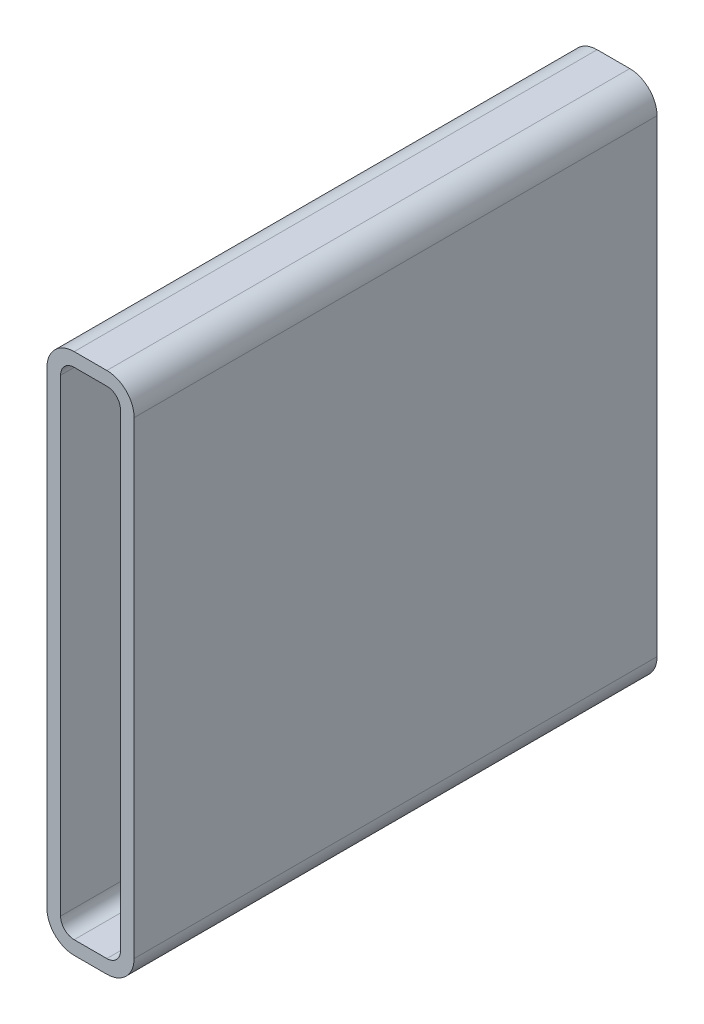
ISO-10303-21;
HEADER;
FILE_DESCRIPTION(('STEP AP214'),'2;1');
FILE_NAME('part.step','',(''),(''),'','','');
FILE_SCHEMA(('AUTOMOTIVE_DESIGN { 1 0 10303 214 1 1 1 1 }'));
ENDSEC;
DATA;
#1=APPLICATION_CONTEXT('core data for automotive mechanical design processes');
#2=APPLICATION_PROTOCOL_DEFINITION('international standard','automotive_design',2000,#1);
#3=PRODUCT_CONTEXT('',#1,'mechanical');
#4=PRODUCT('Part','Part','',(#3));
#5=PRODUCT_RELATED_PRODUCT_CATEGORY('part','',(#4));
#6=PRODUCT_DEFINITION_FORMATION('','',#4);
#7=PRODUCT_DEFINITION_CONTEXT('part definition',#1,'design');
#8=PRODUCT_DEFINITION('design','',#6,#7);
#9=PRODUCT_DEFINITION_SHAPE('','',#8);
#10=(LENGTH_UNIT() NAMED_UNIT(*) SI_UNIT(.MILLI.,.METRE.));
#11=(NAMED_UNIT(*) PLANE_ANGLE_UNIT() SI_UNIT($,.RADIAN.));
#12=(NAMED_UNIT(*) SI_UNIT($,.STERADIAN.) SOLID_ANGLE_UNIT());
#13=UNCERTAINTY_MEASURE_WITH_UNIT(LENGTH_MEASURE(1.E-05),#10,'distance_accuracy_value','');
#14=(GEOMETRIC_REPRESENTATION_CONTEXT(3) GLOBAL_UNCERTAINTY_ASSIGNED_CONTEXT((#13)) GLOBAL_UNIT_ASSIGNED_CONTEXT((#10,
#11,#12)) REPRESENTATION_CONTEXT('',''));
#15=CARTESIAN_POINT('',(0.,0.,0.));
#16=DIRECTION('',(0.,0.,1.));
#17=DIRECTION('',(1.,0.,0.));
#18=AXIS2_PLACEMENT_3D('',#15,#16,#17);
#19=CARTESIAN_POINT('',(15.875,288.925,304.8));
#20=DIRECTION('',(0.,0.,1.));
#21=DIRECTION('',(1.,0.,0.));
#22=AXIS2_PLACEMENT_3D('',#19,#20,#21);
#23=PLANE('',#22);
#24=CARTESIAN_POINT('',(15.875,288.925,304.8));
#25=DIRECTION('',(0.,0.,1.));
#26=DIRECTION('',(1.,0.,0.));
#27=AXIS2_PLACEMENT_3D('',#24,#25,#26);
#28=CIRCLE('',#27,15.875);
#29=CARTESIAN_POINT('',(15.875,304.8,304.8));
#30=VERTEX_POINT('',#29);
#31=CARTESIAN_POINT('',(0.,288.925,304.8));
#32=VERTEX_POINT('',#31);
#33=EDGE_CURVE('E211',#30,#32,#28,.T.);
#34=ORIENTED_EDGE('',*,*,#33,.T.);
#35=DIRECTION('',(0.,-1.,0.));
#36=VECTOR('',#35,1.);
#37=CARTESIAN_POINT('',(0.,15.875,304.8));
#38=LINE('',#37,#36);
#39=CARTESIAN_POINT('',(0.,15.875,304.8));
#40=VERTEX_POINT('',#39);
#41=EDGE_CURVE('E214',#32,#40,#38,.T.);
#42=ORIENTED_EDGE('',*,*,#41,.T.);
#43=CARTESIAN_POINT('',(15.875,15.875,304.8));
#44=DIRECTION('',(0.,0.,1.));
#45=DIRECTION('',(1.,0.,0.));
#46=AXIS2_PLACEMENT_3D('',#43,#44,#45);
#47=CIRCLE('',#46,15.875);
#48=CARTESIAN_POINT('',(15.875,0.,304.8));
#49=VERTEX_POINT('',#48);
#50=EDGE_CURVE('E217',#40,#49,#47,.T.);
#51=ORIENTED_EDGE('',*,*,#50,.T.);
#52=DIRECTION('',(1.,0.,0.));
#53=VECTOR('',#52,1.);
#54=CARTESIAN_POINT('',(34.925,0.,304.8));
#55=LINE('',#54,#53);
#56=CARTESIAN_POINT('',(34.925,0.,304.8));
#57=VERTEX_POINT('',#56);
#58=EDGE_CURVE('E219',#49,#57,#55,.T.);
#59=ORIENTED_EDGE('',*,*,#58,.T.);
#60=CARTESIAN_POINT('',(34.925,15.875,304.8));
#61=DIRECTION('',(0.,0.,1.));
#62=DIRECTION('',(1.,0.,0.));
#63=AXIS2_PLACEMENT_3D('',#60,#61,#62);
#64=CIRCLE('',#63,15.875);
#65=CARTESIAN_POINT('',(50.8,15.875,304.8));
#66=VERTEX_POINT('',#65);
#67=EDGE_CURVE('E221',#57,#66,#64,.T.);
#68=ORIENTED_EDGE('',*,*,#67,.T.);
#69=DIRECTION('',(0.,1.,0.));
#70=VECTOR('',#69,1.);
#71=CARTESIAN_POINT('',(50.8,288.925,304.8));
#72=LINE('',#71,#70);
#73=CARTESIAN_POINT('',(50.8,288.925,304.8));
#74=VERTEX_POINT('',#73);
#75=EDGE_CURVE('E223',#66,#74,#72,.T.);
#76=ORIENTED_EDGE('',*,*,#75,.T.);
#77=CARTESIAN_POINT('',(34.925,288.925,304.8));
#78=DIRECTION('',(0.,0.,1.));
#79=DIRECTION('',(1.,0.,0.));
#80=AXIS2_PLACEMENT_3D('',#77,#78,#79);
#81=CIRCLE('',#80,15.875);
#82=CARTESIAN_POINT('',(34.925,304.8,304.8));
#83=VERTEX_POINT('',#82);
#84=EDGE_CURVE('E225',#74,#83,#81,.T.);
#85=ORIENTED_EDGE('',*,*,#84,.T.);
#86=DIRECTION('',(-1.,0.,0.));
#87=VECTOR('',#86,1.);
#88=CARTESIAN_POINT('',(15.875,304.8,304.8));
#89=LINE('',#88,#87);
#90=EDGE_CURVE('E227',#83,#30,#89,.T.);
#91=ORIENTED_EDGE('',*,*,#90,.T.);
#92=EDGE_LOOP('',(#34,#42,#51,#59,#68,#76,#85,#91));
#93=FACE_BOUND('',#92,.T.);
#94=DIRECTION('',(0.,-1.,0.));
#95=VECTOR('',#94,1.);
#96=CARTESIAN_POINT('',(7.9375,15.875,304.8));
#97=LINE('',#96,#95);
#98=CARTESIAN_POINT('',(7.9375,288.925,304.8));
#99=VERTEX_POINT('',#98);
#100=CARTESIAN_POINT('',(7.9375,15.875,304.8));
#101=VERTEX_POINT('',#100);
#102=EDGE_CURVE('E154',#99,#101,#97,.T.);
#103=ORIENTED_EDGE('',*,*,#102,.F.);
#104=CARTESIAN_POINT('',(15.875,288.925,304.8));
#105=DIRECTION('',(0.,0.,1.));
#106=DIRECTION('',(1.,0.,0.));
#107=AXIS2_PLACEMENT_3D('',#104,#105,#106);
#108=CIRCLE('',#107,7.9375);
#109=CARTESIAN_POINT('',(15.875,296.8625,304.8));
#110=VERTEX_POINT('',#109);
#111=EDGE_CURVE('E146',#110,#99,#108,.T.);
#112=ORIENTED_EDGE('',*,*,#111,.F.);
#113=DIRECTION('',(-1.,0.,0.));
#114=VECTOR('',#113,1.);
#115=CARTESIAN_POINT('',(15.875,296.8625,304.8));
#116=LINE('',#115,#114);
#117=CARTESIAN_POINT('',(34.925,296.8625,304.8));
#118=VERTEX_POINT('',#117);
#119=EDGE_CURVE('E179',#118,#110,#116,.T.);
#120=ORIENTED_EDGE('',*,*,#119,.F.);
#121=CARTESIAN_POINT('',(34.925,288.925,304.8));
#122=DIRECTION('',(0.,0.,1.));
#123=DIRECTION('',(1.,0.,0.));
#124=AXIS2_PLACEMENT_3D('',#121,#122,#123);
#125=CIRCLE('',#124,7.9375);
#126=CARTESIAN_POINT('',(42.8625,288.925,304.8));
#127=VERTEX_POINT('',#126);
#128=EDGE_CURVE('E177',#127,#118,#125,.T.);
#129=ORIENTED_EDGE('',*,*,#128,.F.);
#130=DIRECTION('',(0.,1.,0.));
#131=VECTOR('',#130,1.);
#132=CARTESIAN_POINT('',(42.8625,288.925,304.8));
#133=LINE('',#132,#131);
#134=CARTESIAN_POINT('',(42.8625,15.875,304.8));
#135=VERTEX_POINT('',#134);
#136=EDGE_CURVE('E175',#135,#127,#133,.T.);
#137=ORIENTED_EDGE('',*,*,#136,.F.);
#138=CARTESIAN_POINT('',(34.925,15.875,304.8));
#139=DIRECTION('',(0.,0.,1.));
#140=DIRECTION('',(1.,0.,0.));
#141=AXIS2_PLACEMENT_3D('',#138,#139,#140);
#142=CIRCLE('',#141,7.9375);
#143=CARTESIAN_POINT('',(34.925,7.93750000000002,304.8));
#144=VERTEX_POINT('',#143);
#145=EDGE_CURVE('E173',#144,#135,#142,.T.);
#146=ORIENTED_EDGE('',*,*,#145,.F.);
#147=DIRECTION('',(1.,0.,0.));
#148=VECTOR('',#147,1.);
#149=CARTESIAN_POINT('',(34.925,7.93750000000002,304.8));
#150=LINE('',#149,#148);
#151=CARTESIAN_POINT('',(15.875,7.93750000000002,304.8));
#152=VERTEX_POINT('',#151);
#153=EDGE_CURVE('E169',#152,#144,#150,.T.);
#154=ORIENTED_EDGE('',*,*,#153,.F.);
#155=CARTESIAN_POINT('',(15.875,15.875,304.8));
#156=DIRECTION('',(0.,0.,1.));
#157=DIRECTION('',(1.,0.,0.));
#158=AXIS2_PLACEMENT_3D('',#155,#156,#157);
#159=CIRCLE('',#158,7.9375);
#160=EDGE_CURVE('E167',#101,#152,#159,.T.);
#161=ORIENTED_EDGE('',*,*,#160,.F.);
#162=EDGE_LOOP('',(#103,#112,#120,#129,#137,#146,#154,#161));
#163=FACE_BOUND('',#162,.T.);
#164=ADVANCED_FACE('F33',(#93,#163),#23,.T.);
#165=CARTESIAN_POINT('',(15.875,288.925,0.));
#166=DIRECTION('',(0.,0.,1.));
#167=DIRECTION('',(1.,0.,0.));
#168=AXIS2_PLACEMENT_3D('',#165,#166,#167);
#169=PLANE('',#168);
#170=CARTESIAN_POINT('',(15.875,288.925,0.));
#171=DIRECTION('',(0.,0.,1.));
#172=DIRECTION('',(1.,0.,0.));
#173=AXIS2_PLACEMENT_3D('',#170,#171,#172);
#174=CIRCLE('',#173,15.875);
#175=CARTESIAN_POINT('',(15.875,304.8,0.));
#176=VERTEX_POINT('',#175);
#177=CARTESIAN_POINT('',(0.,288.925,0.));
#178=VERTEX_POINT('',#177);
#179=EDGE_CURVE('E162',#176,#178,#174,.T.);
#180=ORIENTED_EDGE('',*,*,#179,.F.);
#181=DIRECTION('',(-1.,0.,0.));
#182=VECTOR('',#181,1.);
#183=CARTESIAN_POINT('',(15.875,304.8,0.));
#184=LINE('',#183,#182);
#185=CARTESIAN_POINT('',(34.925,304.8,0.));
#186=VERTEX_POINT('',#185);
#187=EDGE_CURVE('E215',#186,#176,#184,.T.);
#188=ORIENTED_EDGE('',*,*,#187,.F.);
#189=CARTESIAN_POINT('',(34.925,288.925,0.));
#190=DIRECTION('',(0.,0.,1.));
#191=DIRECTION('',(1.,0.,0.));
#192=AXIS2_PLACEMENT_3D('',#189,#190,#191);
#193=CIRCLE('',#192,15.875);
#194=CARTESIAN_POINT('',(50.8,288.925,0.));
#195=VERTEX_POINT('',#194);
#196=EDGE_CURVE('E242',#195,#186,#193,.T.);
#197=ORIENTED_EDGE('',*,*,#196,.F.);
#198=DIRECTION('',(0.,1.,0.));
#199=VECTOR('',#198,1.);
#200=CARTESIAN_POINT('',(50.8,288.925,0.));
#201=LINE('',#200,#199);
#202=CARTESIAN_POINT('',(50.8,15.875,0.));
#203=VERTEX_POINT('',#202);
#204=EDGE_CURVE('E240',#203,#195,#201,.T.);
#205=ORIENTED_EDGE('',*,*,#204,.F.);
#206=CARTESIAN_POINT('',(34.925,15.875,0.));
#207=DIRECTION('',(0.,0.,1.));
#208=DIRECTION('',(1.,0.,0.));
#209=AXIS2_PLACEMENT_3D('',#206,#207,#208);
#210=CIRCLE('',#209,15.875);
#211=CARTESIAN_POINT('',(34.925,0.,0.));
#212=VERTEX_POINT('',#211);
#213=EDGE_CURVE('E238',#212,#203,#210,.T.);
#214=ORIENTED_EDGE('',*,*,#213,.F.);
#215=DIRECTION('',(1.,0.,0.));
#216=VECTOR('',#215,1.);
#217=CARTESIAN_POINT('',(34.925,0.,0.));
#218=LINE('',#217,#216);
#219=CARTESIAN_POINT('',(15.875,0.,0.));
#220=VERTEX_POINT('',#219);
#221=EDGE_CURVE('E236',#220,#212,#218,.T.);
#222=ORIENTED_EDGE('',*,*,#221,.F.);
#223=CARTESIAN_POINT('',(15.875,15.875,0.));
#224=DIRECTION('',(0.,0.,1.));
#225=DIRECTION('',(1.,0.,0.));
#226=AXIS2_PLACEMENT_3D('',#223,#224,#225);
#227=CIRCLE('',#226,15.875);
#228=CARTESIAN_POINT('',(0.,15.875,0.));
#229=VERTEX_POINT('',#228);
#230=EDGE_CURVE('E234',#229,#220,#227,.T.);
#231=ORIENTED_EDGE('',*,*,#230,.F.);
#232=DIRECTION('',(0.,-1.,0.));
#233=VECTOR('',#232,1.);
#234=CARTESIAN_POINT('',(0.,15.875,0.));
#235=LINE('',#234,#233);
#236=EDGE_CURVE('E232',#178,#229,#235,.T.);
#237=ORIENTED_EDGE('',*,*,#236,.F.);
#238=EDGE_LOOP('',(#180,#188,#197,#205,#214,#222,#231,#237));
#239=FACE_BOUND('',#238,.T.);
#240=CARTESIAN_POINT('',(15.875,288.925,0.));
#241=DIRECTION('',(0.,0.,1.));
#242=DIRECTION('',(1.,0.,0.));
#243=AXIS2_PLACEMENT_3D('',#240,#241,#242);
#244=CIRCLE('',#243,7.9375);
#245=CARTESIAN_POINT('',(15.875,296.8625,0.));
#246=VERTEX_POINT('',#245);
#247=CARTESIAN_POINT('',(7.9375,288.925,0.));
#248=VERTEX_POINT('',#247);
#249=EDGE_CURVE('E56',#246,#248,#244,.T.);
#250=ORIENTED_EDGE('',*,*,#249,.T.);
#251=DIRECTION('',(0.,-1.,0.));
#252=VECTOR('',#251,1.);
#253=CARTESIAN_POINT('',(7.9375,15.875,0.));
#254=LINE('',#253,#252);
#255=CARTESIAN_POINT('',(7.9375,15.875,0.));
#256=VERTEX_POINT('',#255);
#257=EDGE_CURVE('E161',#248,#256,#254,.T.);
#258=ORIENTED_EDGE('',*,*,#257,.T.);
#259=CARTESIAN_POINT('',(15.875,15.875,0.));
#260=DIRECTION('',(0.,0.,1.));
#261=DIRECTION('',(1.,0.,0.));
#262=AXIS2_PLACEMENT_3D('',#259,#260,#261);
#263=CIRCLE('',#262,7.9375);
#264=CARTESIAN_POINT('',(15.875,7.93750000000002,0.));
#265=VERTEX_POINT('',#264);
#266=EDGE_CURVE('E183',#256,#265,#263,.T.);
#267=ORIENTED_EDGE('',*,*,#266,.T.);
#268=DIRECTION('',(1.,0.,0.));
#269=VECTOR('',#268,1.);
#270=CARTESIAN_POINT('',(34.925,7.93750000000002,0.));
#271=LINE('',#270,#269);
#272=CARTESIAN_POINT('',(34.925,7.93750000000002,0.));
#273=VERTEX_POINT('',#272);
#274=EDGE_CURVE('E186',#265,#273,#271,.T.);
#275=ORIENTED_EDGE('',*,*,#274,.T.);
#276=CARTESIAN_POINT('',(34.925,15.875,0.));
#277=DIRECTION('',(0.,0.,1.));
#278=DIRECTION('',(1.,0.,0.));
#279=AXIS2_PLACEMENT_3D('',#276,#277,#278);
#280=CIRCLE('',#279,7.9375);
#281=CARTESIAN_POINT('',(42.8625,15.875,0.));
#282=VERTEX_POINT('',#281);
#283=EDGE_CURVE('E189',#273,#282,#280,.T.);
#284=ORIENTED_EDGE('',*,*,#283,.T.);
#285=DIRECTION('',(0.,1.,0.));
#286=VECTOR('',#285,1.);
#287=CARTESIAN_POINT('',(42.8625,288.925,0.));
#288=LINE('',#287,#286);
#289=CARTESIAN_POINT('',(42.8625,288.925,0.));
#290=VERTEX_POINT('',#289);
#291=EDGE_CURVE('E192',#282,#290,#288,.T.);
#292=ORIENTED_EDGE('',*,*,#291,.T.);
#293=CARTESIAN_POINT('',(34.925,288.925,0.));
#294=DIRECTION('',(0.,0.,1.));
#295=DIRECTION('',(1.,0.,0.));
#296=AXIS2_PLACEMENT_3D('',#293,#294,#295);
#297=CIRCLE('',#296,7.9375);
#298=CARTESIAN_POINT('',(34.925,296.8625,0.));
#299=VERTEX_POINT('',#298);
#300=EDGE_CURVE('E195',#290,#299,#297,.T.);
#301=ORIENTED_EDGE('',*,*,#300,.T.);
#302=DIRECTION('',(-1.,0.,0.));
#303=VECTOR('',#302,1.);
#304=CARTESIAN_POINT('',(15.875,296.8625,0.));
#305=LINE('',#304,#303);
#306=EDGE_CURVE('E155',#299,#246,#305,.T.);
#307=ORIENTED_EDGE('',*,*,#306,.T.);
#308=EDGE_LOOP('',(#250,#258,#267,#275,#284,#292,#301,#307));
#309=FACE_BOUND('',#308,.T.);
#310=ADVANCED_FACE('F272',(#239,#309),#169,.F.);
#311=CARTESIAN_POINT('',(15.875,288.925,304.8));
#312=DIRECTION('',(0.,0.,-1.));
#313=DIRECTION('',(-1.,0.,0.));
#314=AXIS2_PLACEMENT_3D('',#311,#312,#313);
#315=CYLINDRICAL_SURFACE('',#314,15.875);
#316=ORIENTED_EDGE('',*,*,#179,.T.);
#317=DIRECTION('',(0.,0.,-1.));
#318=VECTOR('',#317,1.);
#319=CARTESIAN_POINT('',(0.,288.925,304.8));
#320=LINE('',#319,#318);
#321=EDGE_CURVE('E11',#32,#178,#320,.T.);
#322=ORIENTED_EDGE('',*,*,#321,.F.);
#323=ORIENTED_EDGE('',*,*,#33,.F.);
#324=DIRECTION('',(0.,0.,-1.));
#325=VECTOR('',#324,1.);
#326=CARTESIAN_POINT('',(15.875,304.8,304.8));
#327=LINE('',#326,#325);
#328=EDGE_CURVE('E229',#30,#176,#327,.T.);
#329=ORIENTED_EDGE('',*,*,#328,.T.);
#330=EDGE_LOOP('',(#316,#322,#323,#329));
#331=FACE_BOUND('',#330,.T.);
#332=ADVANCED_FACE('F35',(#331),#315,.T.);
#333=CARTESIAN_POINT('',(0.,15.875,304.8));
#334=DIRECTION('',(1.,0.,0.));
#335=DIRECTION('',(0.,0.,-1.));
#336=AXIS2_PLACEMENT_3D('',#333,#334,#335);
#337=PLANE('',#336);
#338=ORIENTED_EDGE('',*,*,#236,.T.);
#339=DIRECTION('',(0.,0.,-1.));
#340=VECTOR('',#339,1.);
#341=CARTESIAN_POINT('',(0.,15.875,304.8));
#342=LINE('',#341,#340);
#343=EDGE_CURVE('E41',#40,#229,#342,.T.);
#344=ORIENTED_EDGE('',*,*,#343,.F.);
#345=ORIENTED_EDGE('',*,*,#41,.F.);
#346=ORIENTED_EDGE('',*,*,#321,.T.);
#347=EDGE_LOOP('',(#338,#344,#345,#346));
#348=FACE_BOUND('',#347,.T.);
#349=ADVANCED_FACE('F289',(#348),#337,.F.);
#350=CARTESIAN_POINT('',(15.875,15.875,304.8));
#351=DIRECTION('',(0.,0.,-1.));
#352=DIRECTION('',(-1.,0.,0.));
#353=AXIS2_PLACEMENT_3D('',#350,#351,#352);
#354=CYLINDRICAL_SURFACE('',#353,15.875);
#355=ORIENTED_EDGE('',*,*,#230,.T.);
#356=DIRECTION('',(0.,0.,-1.));
#357=VECTOR('',#356,1.);
#358=CARTESIAN_POINT('',(15.875,0.,304.8));
#359=LINE('',#358,#357);
#360=EDGE_CURVE('E259',#49,#220,#359,.T.);
#361=ORIENTED_EDGE('',*,*,#360,.F.);
#362=ORIENTED_EDGE('',*,*,#50,.F.);
#363=ORIENTED_EDGE('',*,*,#343,.T.);
#364=EDGE_LOOP('',(#355,#361,#362,#363));
#365=FACE_BOUND('',#364,.T.);
#366=ADVANCED_FACE('F266',(#365),#354,.T.);
#367=CARTESIAN_POINT('',(34.925,0.,304.8));
#368=DIRECTION('',(0.,1.,0.));
#369=DIRECTION('',(0.,0.,1.));
#370=AXIS2_PLACEMENT_3D('',#367,#368,#369);
#371=PLANE('',#370);
#372=ORIENTED_EDGE('',*,*,#221,.T.);
#373=DIRECTION('',(0.,0.,-1.));
#374=VECTOR('',#373,1.);
#375=CARTESIAN_POINT('',(34.925,0.,304.8));
#376=LINE('',#375,#374);
#377=EDGE_CURVE('E256',#57,#212,#376,.T.);
#378=ORIENTED_EDGE('',*,*,#377,.F.);
#379=ORIENTED_EDGE('',*,*,#58,.F.);
#380=ORIENTED_EDGE('',*,*,#360,.T.);
#381=EDGE_LOOP('',(#372,#378,#379,#380));
#382=FACE_BOUND('',#381,.T.);
#383=ADVANCED_FACE('F278',(#382),#371,.F.);
#384=CARTESIAN_POINT('',(34.925,15.875,304.8));
#385=DIRECTION('',(0.,0.,-1.));
#386=DIRECTION('',(-1.,0.,0.));
#387=AXIS2_PLACEMENT_3D('',#384,#385,#386);
#388=CYLINDRICAL_SURFACE('',#387,15.875);
#389=ORIENTED_EDGE('',*,*,#213,.T.);
#390=DIRECTION('',(0.,0.,-1.));
#391=VECTOR('',#390,1.);
#392=CARTESIAN_POINT('',(50.8,15.875,304.8));
#393=LINE('',#392,#391);
#394=EDGE_CURVE('E253',#66,#203,#393,.T.);
#395=ORIENTED_EDGE('',*,*,#394,.F.);
#396=ORIENTED_EDGE('',*,*,#67,.F.);
#397=ORIENTED_EDGE('',*,*,#377,.T.);
#398=EDGE_LOOP('',(#389,#395,#396,#397));
#399=FACE_BOUND('',#398,.T.);
#400=ADVANCED_FACE('F282',(#399),#388,.T.);
#401=CARTESIAN_POINT('',(50.8,288.925,304.8));
#402=DIRECTION('',(-1.,0.,0.));
#403=DIRECTION('',(0.,0.,1.));
#404=AXIS2_PLACEMENT_3D('',#401,#402,#403);
#405=PLANE('',#404);
#406=ORIENTED_EDGE('',*,*,#204,.T.);
#407=DIRECTION('',(0.,0.,-1.));
#408=VECTOR('',#407,1.);
#409=CARTESIAN_POINT('',(50.8,288.925,304.8));
#410=LINE('',#409,#408);
#411=EDGE_CURVE('E250',#74,#195,#410,.T.);
#412=ORIENTED_EDGE('',*,*,#411,.F.);
#413=ORIENTED_EDGE('',*,*,#75,.F.);
#414=ORIENTED_EDGE('',*,*,#394,.T.);
#415=EDGE_LOOP('',(#406,#412,#413,#414));
#416=FACE_BOUND('',#415,.T.);
#417=ADVANCED_FACE('F302',(#416),#405,.F.);
#418=CARTESIAN_POINT('',(34.925,288.925,304.8));
#419=DIRECTION('',(0.,0.,-1.));
#420=DIRECTION('',(-1.,0.,0.));
#421=AXIS2_PLACEMENT_3D('',#418,#419,#420);
#422=CYLINDRICAL_SURFACE('',#421,15.875);
#423=ORIENTED_EDGE('',*,*,#196,.T.);
#424=DIRECTION('',(0.,0.,-1.));
#425=VECTOR('',#424,1.);
#426=CARTESIAN_POINT('',(34.925,304.8,304.8));
#427=LINE('',#426,#425);
#428=EDGE_CURVE('E247',#83,#186,#427,.T.);
#429=ORIENTED_EDGE('',*,*,#428,.F.);
#430=ORIENTED_EDGE('',*,*,#84,.F.);
#431=ORIENTED_EDGE('',*,*,#411,.T.);
#432=EDGE_LOOP('',(#423,#429,#430,#431));
#433=FACE_BOUND('',#432,.T.);
#434=ADVANCED_FACE('F300',(#433),#422,.T.);
#435=CARTESIAN_POINT('',(15.875,304.8,304.8));
#436=DIRECTION('',(0.,-1.,0.));
#437=DIRECTION('',(0.,0.,-1.));
#438=AXIS2_PLACEMENT_3D('',#435,#436,#437);
#439=PLANE('',#438);
#440=ORIENTED_EDGE('',*,*,#187,.T.);
#441=ORIENTED_EDGE('',*,*,#328,.F.);
#442=ORIENTED_EDGE('',*,*,#90,.F.);
#443=ORIENTED_EDGE('',*,*,#428,.T.);
#444=EDGE_LOOP('',(#440,#441,#442,#443));
#445=FACE_BOUND('',#444,.T.);
#446=ADVANCED_FACE('F295',(#445),#439,.F.);
#447=CARTESIAN_POINT('',(15.875,288.925,304.8));
#448=DIRECTION('',(0.,0.,-1.));
#449=DIRECTION('',(-1.,0.,0.));
#450=AXIS2_PLACEMENT_3D('',#447,#448,#449);
#451=CYLINDRICAL_SURFACE('',#450,7.9375);
#452=ORIENTED_EDGE('',*,*,#249,.F.);
#453=DIRECTION('',(0.,0.,-1.));
#454=VECTOR('',#453,1.);
#455=CARTESIAN_POINT('',(15.875,296.8625,304.8));
#456=LINE('',#455,#454);
#457=EDGE_CURVE('E150',#110,#246,#456,.T.);
#458=ORIENTED_EDGE('',*,*,#457,.F.);
#459=ORIENTED_EDGE('',*,*,#111,.T.);
#460=DIRECTION('',(0.,0.,-1.));
#461=VECTOR('',#460,1.);
#462=CARTESIAN_POINT('',(7.9375,288.925,304.8));
#463=LINE('',#462,#461);
#464=EDGE_CURVE('E149',#99,#248,#463,.T.);
#465=ORIENTED_EDGE('',*,*,#464,.T.);
#466=EDGE_LOOP('',(#452,#458,#459,#465));
#467=FACE_BOUND('',#466,.T.);
#468=ADVANCED_FACE('F148',(#467),#451,.F.);
#469=CARTESIAN_POINT('',(7.9375,15.875,304.8));
#470=DIRECTION('',(1.,0.,0.));
#471=DIRECTION('',(0.,0.,-1.));
#472=AXIS2_PLACEMENT_3D('',#469,#470,#471);
#473=PLANE('',#472);
#474=ORIENTED_EDGE('',*,*,#257,.F.);
#475=ORIENTED_EDGE('',*,*,#464,.F.);
#476=ORIENTED_EDGE('',*,*,#102,.T.);
#477=DIRECTION('',(0.,0.,-1.));
#478=VECTOR('',#477,1.);
#479=CARTESIAN_POINT('',(7.9375,15.875,304.8));
#480=LINE('',#479,#478);
#481=EDGE_CURVE('E163',#101,#256,#480,.T.);
#482=ORIENTED_EDGE('',*,*,#481,.T.);
#483=EDGE_LOOP('',(#474,#475,#476,#482));
#484=FACE_BOUND('',#483,.T.);
#485=ADVANCED_FACE('F158',(#484),#473,.T.);
#486=CARTESIAN_POINT('',(15.875,15.875,304.8));
#487=DIRECTION('',(0.,0.,-1.));
#488=DIRECTION('',(-1.,0.,0.));
#489=AXIS2_PLACEMENT_3D('',#486,#487,#488);
#490=CYLINDRICAL_SURFACE('',#489,7.9375);
#491=ORIENTED_EDGE('',*,*,#266,.F.);
#492=ORIENTED_EDGE('',*,*,#481,.F.);
#493=ORIENTED_EDGE('',*,*,#160,.T.);
#494=DIRECTION('',(0.,0.,-1.));
#495=VECTOR('',#494,1.);
#496=CARTESIAN_POINT('',(15.875,7.93750000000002,304.8));
#497=LINE('',#496,#495);
#498=EDGE_CURVE('E208',#152,#265,#497,.T.);
#499=ORIENTED_EDGE('',*,*,#498,.T.);
#500=EDGE_LOOP('',(#491,#492,#493,#499));
#501=FACE_BOUND('',#500,.T.);
#502=ADVANCED_FACE('F327',(#501),#490,.F.);
#503=CARTESIAN_POINT('',(34.925,7.93750000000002,304.8));
#504=DIRECTION('',(0.,1.,0.));
#505=DIRECTION('',(0.,0.,1.));
#506=AXIS2_PLACEMENT_3D('',#503,#504,#505);
#507=PLANE('',#506);
#508=ORIENTED_EDGE('',*,*,#274,.F.);
#509=ORIENTED_EDGE('',*,*,#498,.F.);
#510=ORIENTED_EDGE('',*,*,#153,.T.);
#511=DIRECTION('',(0.,0.,-1.));
#512=VECTOR('',#511,1.);
#513=CARTESIAN_POINT('',(34.925,7.93750000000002,304.8));
#514=LINE('',#513,#512);
#515=EDGE_CURVE('E206',#144,#273,#514,.T.);
#516=ORIENTED_EDGE('',*,*,#515,.T.);
#517=EDGE_LOOP('',(#508,#509,#510,#516));
#518=FACE_BOUND('',#517,.T.);
#519=ADVANCED_FACE('F331',(#518),#507,.T.);
#520=CARTESIAN_POINT('',(34.925,15.875,304.8));
#521=DIRECTION('',(0.,0.,-1.));
#522=DIRECTION('',(-1.,0.,0.));
#523=AXIS2_PLACEMENT_3D('',#520,#521,#522);
#524=CYLINDRICAL_SURFACE('',#523,7.9375);
#525=ORIENTED_EDGE('',*,*,#283,.F.);
#526=ORIENTED_EDGE('',*,*,#515,.F.);
#527=ORIENTED_EDGE('',*,*,#145,.T.);
#528=DIRECTION('',(0.,0.,-1.));
#529=VECTOR('',#528,1.);
#530=CARTESIAN_POINT('',(42.8625,15.875,304.8));
#531=LINE('',#530,#529);
#532=EDGE_CURVE('E204',#135,#282,#531,.T.);
#533=ORIENTED_EDGE('',*,*,#532,.T.);
#534=EDGE_LOOP('',(#525,#526,#527,#533));
#535=FACE_BOUND('',#534,.T.);
#536=ADVANCED_FACE('F337',(#535),#524,.F.);
#537=CARTESIAN_POINT('',(42.8625,288.925,304.8));
#538=DIRECTION('',(-1.,0.,0.));
#539=DIRECTION('',(0.,0.,1.));
#540=AXIS2_PLACEMENT_3D('',#537,#538,#539);
#541=PLANE('',#540);
#542=ORIENTED_EDGE('',*,*,#291,.F.);
#543=ORIENTED_EDGE('',*,*,#532,.F.);
#544=ORIENTED_EDGE('',*,*,#136,.T.);
#545=DIRECTION('',(0.,0.,-1.));
#546=VECTOR('',#545,1.);
#547=CARTESIAN_POINT('',(42.8625,288.925,304.8));
#548=LINE('',#547,#546);
#549=EDGE_CURVE('E202',#127,#290,#548,.T.);
#550=ORIENTED_EDGE('',*,*,#549,.T.);
#551=EDGE_LOOP('',(#542,#543,#544,#550));
#552=FACE_BOUND('',#551,.T.);
#553=ADVANCED_FACE('F341',(#552),#541,.T.);
#554=CARTESIAN_POINT('',(34.925,288.925,304.8));
#555=DIRECTION('',(0.,0.,-1.));
#556=DIRECTION('',(-1.,0.,0.));
#557=AXIS2_PLACEMENT_3D('',#554,#555,#556);
#558=CYLINDRICAL_SURFACE('',#557,7.9375);
#559=ORIENTED_EDGE('',*,*,#300,.F.);
#560=ORIENTED_EDGE('',*,*,#549,.F.);
#561=ORIENTED_EDGE('',*,*,#128,.T.);
#562=DIRECTION('',(0.,0.,-1.));
#563=VECTOR('',#562,1.);
#564=CARTESIAN_POINT('',(34.925,296.8625,304.8));
#565=LINE('',#564,#563);
#566=EDGE_CURVE('E48',#118,#299,#565,.T.);
#567=ORIENTED_EDGE('',*,*,#566,.T.);
#568=EDGE_LOOP('',(#559,#560,#561,#567));
#569=FACE_BOUND('',#568,.T.);
#570=ADVANCED_FACE('F345',(#569),#558,.F.);
#571=CARTESIAN_POINT('',(15.875,296.8625,304.8));
#572=DIRECTION('',(0.,-1.,0.));
#573=DIRECTION('',(0.,0.,-1.));
#574=AXIS2_PLACEMENT_3D('',#571,#572,#573);
#575=PLANE('',#574);
#576=ORIENTED_EDGE('',*,*,#306,.F.);
#577=ORIENTED_EDGE('',*,*,#566,.F.);
#578=ORIENTED_EDGE('',*,*,#119,.T.);
#579=ORIENTED_EDGE('',*,*,#457,.T.);
#580=EDGE_LOOP('',(#576,#577,#578,#579));
#581=FACE_BOUND('',#580,.T.);
#582=ADVANCED_FACE('F349',(#581),#575,.T.);
#583=CLOSED_SHELL('',(#164,#310,#332,#349,#366,#383,#400,#417,#434,#446,#468,#485,#502,#519,
#536,#553,#570,#582));
#584=MANIFOLD_SOLID_BREP('B2',#583);
#585=ADVANCED_BREP_SHAPE_REPRESENTATION('',(#18,#584),#14);
#586=SHAPE_DEFINITION_REPRESENTATION(#9,#585);
ENDSEC;
END-ISO-10303-21;
